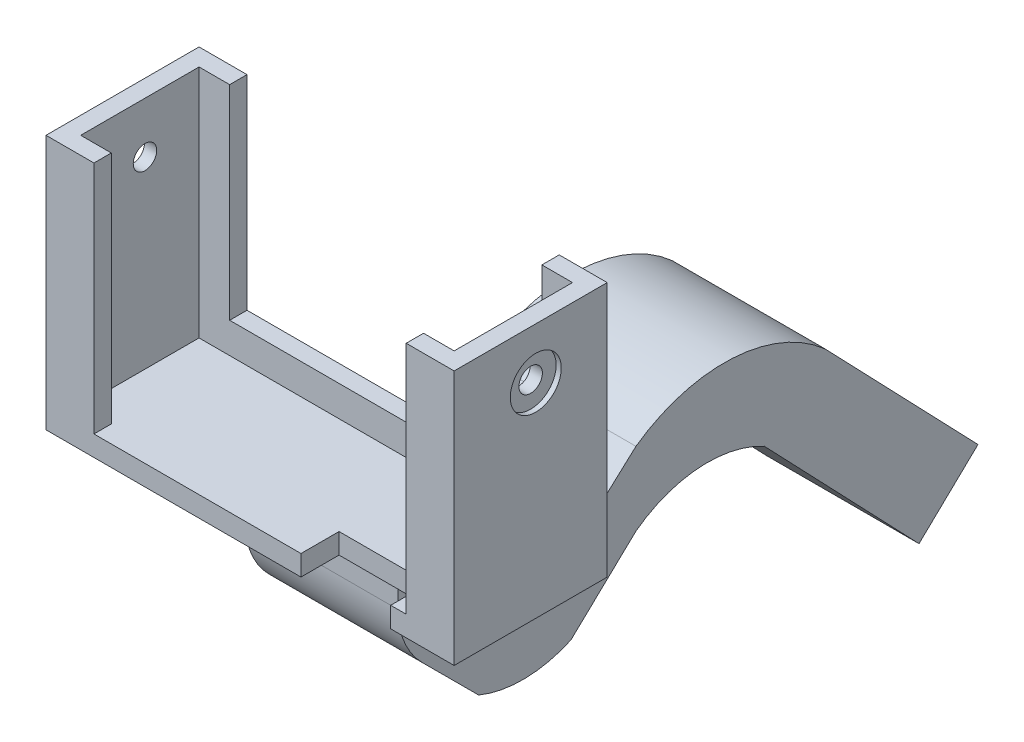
ISO-10303-21;
HEADER;
FILE_DESCRIPTION(('STEP AP214'),'2;1');
FILE_NAME('part.step','',(''),(''),'','','');
FILE_SCHEMA(('AUTOMOTIVE_DESIGN { 1 0 10303 214 1 1 1 1 }'));
ENDSEC;
DATA;
#1=APPLICATION_CONTEXT('core data for automotive mechanical design processes');
#2=APPLICATION_PROTOCOL_DEFINITION('international standard','automotive_design',2000,#1);
#3=PRODUCT_CONTEXT('',#1,'mechanical');
#4=PRODUCT('Part','Part','',(#3));
#5=PRODUCT_RELATED_PRODUCT_CATEGORY('part','',(#4));
#6=PRODUCT_DEFINITION_FORMATION('','',#4);
#7=PRODUCT_DEFINITION_CONTEXT('part definition',#1,'design');
#8=PRODUCT_DEFINITION('design','',#6,#7);
#9=PRODUCT_DEFINITION_SHAPE('','',#8);
#10=(LENGTH_UNIT() NAMED_UNIT(*) SI_UNIT(.MILLI.,.METRE.));
#11=(NAMED_UNIT(*) PLANE_ANGLE_UNIT() SI_UNIT($,.RADIAN.));
#12=(NAMED_UNIT(*) SI_UNIT($,.STERADIAN.) SOLID_ANGLE_UNIT());
#13=UNCERTAINTY_MEASURE_WITH_UNIT(LENGTH_MEASURE(1.E-05),#10,'distance_accuracy_value','');
#14=(GEOMETRIC_REPRESENTATION_CONTEXT(3) GLOBAL_UNCERTAINTY_ASSIGNED_CONTEXT((#13)) GLOBAL_UNIT_ASSIGNED_CONTEXT((#10,
#11,#12)) REPRESENTATION_CONTEXT('',''));
#15=CARTESIAN_POINT('',(0.,0.,0.));
#16=DIRECTION('',(0.,0.,1.));
#17=DIRECTION('',(1.,0.,0.));
#18=AXIS2_PLACEMENT_3D('',#15,#16,#17);
#19=CARTESIAN_POINT('',(-20.,5.,11.));
#20=DIRECTION('',(0.,0.,1.));
#21=DIRECTION('',(1.,0.,0.));
#22=AXIS2_PLACEMENT_3D('',#19,#20,#21);
#23=PLANE('',#22);
#24=DIRECTION('',(0.,1.,0.));
#25=VECTOR('',#24,1.);
#26=CARTESIAN_POINT('',(13.780528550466,-3.,11.));
#27=LINE('',#26,#25);
#28=CARTESIAN_POINT('',(13.780528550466,5.,11.));
#29=VERTEX_POINT('',#28);
#30=CARTESIAN_POINT('',(13.780528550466,7.,11.));
#31=VERTEX_POINT('',#30);
#32=EDGE_CURVE('E523',#29,#31,#27,.T.);
#33=ORIENTED_EDGE('',*,*,#32,.F.);
#34=DIRECTION('',(1.,0.,0.));
#35=VECTOR('',#34,1.);
#36=CARTESIAN_POINT('',(-20.,5.,11.));
#37=LINE('',#36,#35);
#38=CARTESIAN_POINT('',(20.,5.,11.));
#39=VERTEX_POINT('',#38);
#40=EDGE_CURVE('E433',#29,#39,#37,.T.);
#41=ORIENTED_EDGE('',*,*,#40,.T.);
#42=DIRECTION('',(0.,1.,0.));
#43=VECTOR('',#42,1.);
#44=CARTESIAN_POINT('',(20.,5.,11.));
#45=LINE('',#44,#43);
#46=CARTESIAN_POINT('',(20.,30.,11.));
#47=VERTEX_POINT('',#46);
#48=EDGE_CURVE('E438',#39,#47,#45,.T.);
#49=ORIENTED_EDGE('',*,*,#48,.T.);
#50=DIRECTION('',(1.,0.,0.));
#51=VECTOR('',#50,1.);
#52=CARTESIAN_POINT('',(-20.,30.,11.));
#53=LINE('',#52,#51);
#54=CARTESIAN_POINT('',(15.3,30.,11.));
#55=VERTEX_POINT('',#54);
#56=EDGE_CURVE('E419',#55,#47,#53,.T.);
#57=ORIENTED_EDGE('',*,*,#56,.F.);
#58=DIRECTION('',(0.,-1.,0.));
#59=VECTOR('',#58,1.);
#60=CARTESIAN_POINT('',(15.3,30.,11.));
#61=LINE('',#60,#59);
#62=CARTESIAN_POINT('',(15.3,7.,11.));
#63=VERTEX_POINT('',#62);
#64=EDGE_CURVE('E343',#55,#63,#61,.T.);
#65=ORIENTED_EDGE('',*,*,#64,.T.);
#66=DIRECTION('',(1.,0.,0.));
#67=VECTOR('',#66,1.);
#68=CARTESIAN_POINT('',(15.3,7.,11.));
#69=LINE('',#68,#67);
#70=EDGE_CURVE('E332',#31,#63,#69,.T.);
#71=ORIENTED_EDGE('',*,*,#70,.F.);
#72=EDGE_LOOP('',(#33,#41,#49,#57,#65,#71));
#73=FACE_BOUND('',#72,.T.);
#74=ADVANCED_FACE('F39',(#73),#23,.T.);
#75=CARTESIAN_POINT('',(-20.001,25.,3.));
#76=DIRECTION('',(1.,0.,0.));
#77=DIRECTION('',(0.,0.,-1.));
#78=AXIS2_PLACEMENT_3D('',#75,#76,#77);
#79=CYLINDRICAL_SURFACE('',#78,1.15);
#80=CARTESIAN_POINT('',(18.3,25.,3.));
#81=DIRECTION('',(-1.,0.,0.));
#82=DIRECTION('',(0.,0.,1.));
#83=AXIS2_PLACEMENT_3D('',#80,#81,#82);
#84=CIRCLE('',#83,1.15);
#85=CARTESIAN_POINT('',(18.3,25.,4.15));
#86=VERTEX_POINT('',#85);
#87=EDGE_CURVE('E319',#86,#86,#84,.T.);
#88=ORIENTED_EDGE('',*,*,#87,.T.);
#89=EDGE_LOOP('',(#88));
#90=FACE_BOUND('',#89,.T.);
#91=CARTESIAN_POINT('',(19.5,25.,3.));
#92=DIRECTION('',(1.,0.,0.));
#93=DIRECTION('',(0.,0.,-1.));
#94=AXIS2_PLACEMENT_3D('',#91,#92,#93);
#95=CIRCLE('',#94,1.15);
#96=CARTESIAN_POINT('',(19.5,25.,1.85));
#97=VERTEX_POINT('',#96);
#98=EDGE_CURVE('E43',#97,#97,#95,.T.);
#99=ORIENTED_EDGE('',*,*,#98,.T.);
#100=EDGE_LOOP('',(#99));
#101=FACE_BOUND('',#100,.T.);
#102=ADVANCED_FACE('F479',(#90,#101),#79,.F.);
#103=CARTESIAN_POINT('',(20.001,25.,3.));
#104=DIRECTION('',(-1.,0.,0.));
#105=DIRECTION('',(0.,0.,1.));
#106=AXIS2_PLACEMENT_3D('',#103,#104,#105);
#107=CYLINDRICAL_SURFACE('',#106,1.15);
#108=CARTESIAN_POINT('',(-18.3,25.,3.));
#109=DIRECTION('',(1.,0.,0.));
#110=DIRECTION('',(0.,0.,-1.));
#111=AXIS2_PLACEMENT_3D('',#108,#109,#110);
#112=CIRCLE('',#111,1.15);
#113=CARTESIAN_POINT('',(-18.3,25.,1.85));
#114=VERTEX_POINT('',#113);
#115=EDGE_CURVE('E329',#114,#114,#112,.F.);
#116=ORIENTED_EDGE('',*,*,#115,.F.);
#117=EDGE_LOOP('',(#116));
#118=FACE_BOUND('',#117,.T.);
#119=CARTESIAN_POINT('',(-19.5,25.,3.));
#120=DIRECTION('',(-1.,0.,0.));
#121=DIRECTION('',(0.,0.,1.));
#122=AXIS2_PLACEMENT_3D('',#119,#120,#121);
#123=CIRCLE('',#122,1.15);
#124=CARTESIAN_POINT('',(-19.5,25.,4.15));
#125=VERTEX_POINT('',#124);
#126=EDGE_CURVE('E326',#125,#125,#123,.F.);
#127=ORIENTED_EDGE('',*,*,#126,.F.);
#128=EDGE_LOOP('',(#127));
#129=FACE_BOUND('',#128,.T.);
#130=ADVANCED_FACE('F476',(#118,#129),#107,.F.);
#131=CARTESIAN_POINT('',(-18.3,30.,9.3));
#132=DIRECTION('',(0.,0.,-1.));
#133=DIRECTION('',(-1.,0.,0.));
#134=AXIS2_PLACEMENT_3D('',#131,#132,#133);
#135=PLANE('',#134);
#136=DIRECTION('',(0.,1.,0.));
#137=VECTOR('',#136,1.);
#138=CARTESIAN_POINT('',(-15.3,30.,9.3));
#139=LINE('',#138,#137);
#140=CARTESIAN_POINT('',(-15.3,7.,9.3));
#141=VERTEX_POINT('',#140);
#142=CARTESIAN_POINT('',(-15.3,30.,9.3));
#143=VERTEX_POINT('',#142);
#144=EDGE_CURVE('E48',#141,#143,#139,.T.);
#145=ORIENTED_EDGE('',*,*,#144,.F.);
#146=DIRECTION('',(1.,0.,0.));
#147=VECTOR('',#146,1.);
#148=CARTESIAN_POINT('',(-18.3,7.,9.3));
#149=LINE('',#148,#147);
#150=CARTESIAN_POINT('',(-18.3,7.,9.3));
#151=VERTEX_POINT('',#150);
#152=EDGE_CURVE('E378',#151,#141,#149,.T.);
#153=ORIENTED_EDGE('',*,*,#152,.F.);
#154=DIRECTION('',(0.,-1.,0.));
#155=VECTOR('',#154,1.);
#156=CARTESIAN_POINT('',(-18.3,30.,9.3));
#157=LINE('',#156,#155);
#158=CARTESIAN_POINT('',(-18.3,30.,9.3));
#159=VERTEX_POINT('',#158);
#160=EDGE_CURVE('E400',#159,#151,#157,.T.);
#161=ORIENTED_EDGE('',*,*,#160,.F.);
#162=DIRECTION('',(1.,0.,0.));
#163=VECTOR('',#162,1.);
#164=CARTESIAN_POINT('',(-18.3,30.,9.3));
#165=LINE('',#164,#163);
#166=EDGE_CURVE('E386',#159,#143,#165,.T.);
#167=ORIENTED_EDGE('',*,*,#166,.T.);
#168=EDGE_LOOP('',(#145,#153,#161,#167));
#169=FACE_BOUND('',#168,.T.);
#170=ADVANCED_FACE('F478',(#169),#135,.T.);
#171=CARTESIAN_POINT('',(0.,30.,0.));
#172=DIRECTION('',(0.,1.,0.));
#173=DIRECTION('',(0.,0.,1.));
#174=AXIS2_PLACEMENT_3D('',#171,#172,#173);
#175=PLANE('',#174);
#176=DIRECTION('',(0.,0.,-1.));
#177=VECTOR('',#176,1.);
#178=CARTESIAN_POINT('',(15.3,30.,11.));
#179=LINE('',#178,#177);
#180=CARTESIAN_POINT('',(15.3,30.,9.3));
#181=VERTEX_POINT('',#180);
#182=EDGE_CURVE('E357',#55,#181,#179,.T.);
#183=ORIENTED_EDGE('',*,*,#182,.F.);
#184=ORIENTED_EDGE('',*,*,#56,.T.);
#185=DIRECTION('',(0.,0.,-1.));
#186=VECTOR('',#185,1.);
#187=CARTESIAN_POINT('',(20.,30.,-4.));
#188=LINE('',#187,#186);
#189=CARTESIAN_POINT('',(20.,30.,-4.));
#190=VERTEX_POINT('',#189);
#191=EDGE_CURVE('E409',#47,#190,#188,.T.);
#192=ORIENTED_EDGE('',*,*,#191,.T.);
#193=DIRECTION('',(-1.,0.,0.));
#194=VECTOR('',#193,1.);
#195=CARTESIAN_POINT('',(-20.,30.,-4.));
#196=LINE('',#195,#194);
#197=CARTESIAN_POINT('',(15.3,30.,-4.));
#198=VERTEX_POINT('',#197);
#199=EDGE_CURVE('E413',#190,#198,#196,.T.);
#200=ORIENTED_EDGE('',*,*,#199,.T.);
#201=CARTESIAN_POINT('',(15.3,30.,-2.3));
#202=VERTEX_POINT('',#201);
#203=EDGE_CURVE('E360',#202,#198,#179,.T.);
#204=ORIENTED_EDGE('',*,*,#203,.F.);
#205=DIRECTION('',(-1.,0.,0.));
#206=VECTOR('',#205,1.);
#207=CARTESIAN_POINT('',(-18.3,30.,-2.3));
#208=LINE('',#207,#206);
#209=CARTESIAN_POINT('',(18.3,30.,-2.3));
#210=VERTEX_POINT('',#209);
#211=EDGE_CURVE('E379',#210,#202,#208,.T.);
#212=ORIENTED_EDGE('',*,*,#211,.F.);
#213=DIRECTION('',(0.,0.,-1.));
#214=VECTOR('',#213,1.);
#215=CARTESIAN_POINT('',(18.3,30.,-2.3));
#216=LINE('',#215,#214);
#217=CARTESIAN_POINT('',(18.3,30.,9.3));
#218=VERTEX_POINT('',#217);
#219=EDGE_CURVE('E375',#218,#210,#216,.T.);
#220=ORIENTED_EDGE('',*,*,#219,.F.);
#221=EDGE_CURVE('E385',#181,#218,#165,.T.);
#222=ORIENTED_EDGE('',*,*,#221,.F.);
#223=EDGE_LOOP('',(#183,#184,#192,#200,#204,#212,#220,#222));
#224=FACE_BOUND('',#223,.T.);
#225=ADVANCED_FACE('F486',(#224),#175,.T.);
#226=CARTESIAN_POINT('',(7.5,7.,-4.));
#227=DIRECTION('',(-1.,0.,0.));
#228=DIRECTION('',(0.,0.,1.));
#229=AXIS2_PLACEMENT_3D('',#226,#227,#228);
#230=PLANE('',#229);
#231=DIRECTION('',(0.,0.,-1.));
#232=VECTOR('',#231,1.);
#233=CARTESIAN_POINT('',(7.5,5.,-4.));
#234=LINE('',#233,#232);
#235=CARTESIAN_POINT('',(7.5,5.,4.));
#236=VERTEX_POINT('',#235);
#237=CARTESIAN_POINT('',(7.5,5.,-4.));
#238=VERTEX_POINT('',#237);
#239=EDGE_CURVE('E449',#236,#238,#234,.T.);
#240=ORIENTED_EDGE('',*,*,#239,.F.);
#241=DIRECTION('',(0.,-1.,0.));
#242=VECTOR('',#241,1.);
#243=CARTESIAN_POINT('',(7.5,7.,4.));
#244=LINE('',#243,#242);
#245=CARTESIAN_POINT('',(7.49999999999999,0.,4.));
#246=VERTEX_POINT('',#245);
#247=EDGE_CURVE('E457',#236,#246,#244,.T.);
#248=ORIENTED_EDGE('',*,*,#247,.T.);
#249=CARTESIAN_POINT('',(7.49999999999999,0.,-4.));
#250=DIRECTION('',(-1.,0.,0.));
#251=DIRECTION('',(0.,0.,1.));
#252=AXIS2_PLACEMENT_3D('',#249,#250,#251);
#253=CIRCLE('',#252,8.);
#254=CARTESIAN_POINT('',(7.49999999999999,-5.65685424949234,1.65685424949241));
#255=VERTEX_POINT('',#254);
#256=EDGE_CURVE('E318',#246,#255,#253,.F.);
#257=ORIENTED_EDGE('',*,*,#256,.T.);
#258=DIRECTION('',(0.,-0.706826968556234,-0.707386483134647));
#259=VECTOR('',#258,1.);
#260=CARTESIAN_POINT('',(7.49999999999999,-11.213954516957,-3.90464494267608));
#261=LINE('',#260,#259);
#262=CARTESIAN_POINT('',(7.49999999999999,-11.2139545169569,-3.90464494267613));
#263=VERTEX_POINT('',#262);
#264=EDGE_CURVE('E579',#255,#263,#261,.T.);
#265=ORIENTED_EDGE('',*,*,#264,.T.);
#266=CARTESIAN_POINT('',(7.49999999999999,-0.729745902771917,-8.24640038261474));
#267=DIRECTION('',(-1.,0.,0.));
#268=DIRECTION('',(0.,0.,1.));
#269=AXIS2_PLACEMENT_3D('',#266,#267,#268);
#270=CIRCLE('',#269,11.3476636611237);
#271=CARTESIAN_POINT('',(7.49999999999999,-11.0594965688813,-12.9438168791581));
#272=VERTEX_POINT('',#271);
#273=EDGE_CURVE('E577',#263,#272,#270,.F.);
#274=ORIENTED_EDGE('',*,*,#273,.T.);
#275=DIRECTION('',(0.,0.688719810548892,-0.725027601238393));
#276=VECTOR('',#275,1.);
#277=CARTESIAN_POINT('',(7.49999999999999,-11.0594965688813,-12.9438168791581));
#278=LINE('',#277,#276);
#279=CARTESIAN_POINT('',(7.49999999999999,-5.00448849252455,-19.31803163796));
#280=VERTEX_POINT('',#279);
#281=EDGE_CURVE('E575',#272,#280,#278,.T.);
#282=ORIENTED_EDGE('',*,*,#281,.T.);
#283=CARTESIAN_POINT('',(7.49999999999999,-14.4124139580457,-26.3244704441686));
#284=DIRECTION('',(-1.,0.,0.));
#285=DIRECTION('',(0.,0.,1.));
#286=AXIS2_PLACEMENT_3D('',#283,#284,#285);
#287=CIRCLE('',#286,11.7302705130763);
#288=CARTESIAN_POINT('',(7.49999999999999,-4.09263623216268,-31.9013364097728));
#289=VERTEX_POINT('',#288);
#290=EDGE_CURVE('E290',#280,#289,#287,.T.);
#291=ORIENTED_EDGE('',*,*,#290,.T.);
#292=DIRECTION('',(0.,-0.722672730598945,-0.691190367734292));
#293=VECTOR('',#292,1.);
#294=CARTESIAN_POINT('',(7.49999999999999,-4.09263623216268,-31.9013364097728));
#295=LINE('',#294,#293);
#296=CARTESIAN_POINT('',(7.49999999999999,-19.9419368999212,-47.0601814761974));
#297=VERTEX_POINT('',#296);
#298=EDGE_CURVE('E572',#289,#297,#295,.T.);
#299=ORIENTED_EDGE('',*,*,#298,.T.);
#300=DIRECTION('',(0.,0.69119036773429,-0.722672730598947));
#301=VECTOR('',#300,1.);
#302=CARTESIAN_POINT('',(7.49999999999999,-19.9419368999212,-47.0601814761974));
#303=LINE('',#302,#301);
#304=CARTESIAN_POINT('',(7.49999999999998,-14.4124139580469,-52.841563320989));
#305=VERTEX_POINT('',#304);
#306=EDGE_CURVE('E570',#297,#305,#303,.T.);
#307=ORIENTED_EDGE('',*,*,#306,.T.);
#308=DIRECTION('',(0.,0.721242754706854,0.692682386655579));
#309=VECTOR('',#308,1.);
#310=CARTESIAN_POINT('',(7.49999999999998,-14.4124139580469,-52.841563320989));
#311=LINE('',#310,#309);
#312=CARTESIAN_POINT('',(7.49999999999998,1.19381417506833,-37.8533235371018));
#313=VERTEX_POINT('',#312);
#314=EDGE_CURVE('E568',#305,#313,#311,.T.);
#315=ORIENTED_EDGE('',*,*,#314,.T.);
#316=CARTESIAN_POINT('',(7.49999999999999,-9.9342706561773,-27.9587100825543));
#317=DIRECTION('',(-1.,0.,0.));
#318=DIRECTION('',(0.,0.,1.));
#319=AXIS2_PLACEMENT_3D('',#316,#317,#318);
#320=CIRCLE('',#319,14.8908578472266);
#321=CARTESIAN_POINT('',(7.49999999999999,2.1932321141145,-19.3180316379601));
#322=VERTEX_POINT('',#321);
#323=EDGE_CURVE('E566',#313,#322,#320,.F.);
#324=ORIENTED_EDGE('',*,*,#323,.T.);
#325=DIRECTION('',(0.,-0.673918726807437,0.738805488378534));
#326=VECTOR('',#325,1.);
#327=CARTESIAN_POINT('',(7.49999999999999,2.19323211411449,-19.3180316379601));
#328=LINE('',#327,#326);
#329=CARTESIAN_POINT('',(7.49999999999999,-3.62115714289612,-12.9438168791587));
#330=VERTEX_POINT('',#329);
#331=EDGE_CURVE('E564',#322,#330,#328,.T.);
#332=ORIENTED_EDGE('',*,*,#331,.T.);
#333=CARTESIAN_POINT('',(7.49999999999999,2.54718683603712,-10.5830821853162));
#334=DIRECTION('',(-1.,0.,0.));
#335=DIRECTION('',(0.,0.,1.));
#336=AXIS2_PLACEMENT_3D('',#333,#334,#335);
#337=CIRCLE('',#336,6.60466015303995);
#338=CARTESIAN_POINT('',(7.49999999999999,-3.1484017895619,-7.23916144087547));
#339=VERTEX_POINT('',#338);
#340=EDGE_CURVE('E561',#330,#339,#337,.T.);
#341=ORIENTED_EDGE('',*,*,#340,.T.);
#342=DIRECTION('',(0.,0.696989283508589,0.717081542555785));
#343=VECTOR('',#342,1.);
#344=CARTESIAN_POINT('',(7.49999999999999,0.,-4.));
#345=LINE('',#344,#343);
#346=CARTESIAN_POINT('',(7.5,0.,-4.));
#347=VERTEX_POINT('',#346);
#348=EDGE_CURVE('E558',#339,#347,#345,.T.);
#349=ORIENTED_EDGE('',*,*,#348,.T.);
#350=DIRECTION('',(0.,-1.,0.));
#351=VECTOR('',#350,1.);
#352=CARTESIAN_POINT('',(7.5,7.,-4.));
#353=LINE('',#352,#351);
#354=EDGE_CURVE('E466',#238,#347,#353,.T.);
#355=ORIENTED_EDGE('',*,*,#354,.F.);
#356=EDGE_LOOP('',(#240,#248,#257,#265,#274,#282,#291,#299,#307,#315,#324,#332,#341,#349,#355));
#357=FACE_BOUND('',#356,.T.);
#358=ADVANCED_FACE('F41',(#357),#230,.F.);
#359=CARTESIAN_POINT('',(-7.5,7.,-4.));
#360=DIRECTION('',(1.,0.,0.));
#361=DIRECTION('',(0.,0.,-1.));
#362=AXIS2_PLACEMENT_3D('',#359,#360,#361);
#363=PLANE('',#362);
#364=DIRECTION('',(0.,0.,1.));
#365=VECTOR('',#364,1.);
#366=CARTESIAN_POINT('',(-7.5,5.,-4.));
#367=LINE('',#366,#365);
#368=CARTESIAN_POINT('',(-7.5,5.,-4.));
#369=VERTEX_POINT('',#368);
#370=CARTESIAN_POINT('',(-7.5,5.,4.));
#371=VERTEX_POINT('',#370);
#372=EDGE_CURVE('E441',#369,#371,#367,.T.);
#373=ORIENTED_EDGE('',*,*,#372,.F.);
#374=DIRECTION('',(0.,-1.,0.));
#375=VECTOR('',#374,1.);
#376=CARTESIAN_POINT('',(-7.5,7.,-4.));
#377=LINE('',#376,#375);
#378=CARTESIAN_POINT('',(-7.5,0.,-4.));
#379=VERTEX_POINT('',#378);
#380=EDGE_CURVE('E463',#369,#379,#377,.T.);
#381=ORIENTED_EDGE('',*,*,#380,.T.);
#382=DIRECTION('',(0.,-0.696989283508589,-0.717081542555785));
#383=VECTOR('',#382,1.);
#384=CARTESIAN_POINT('',(-7.5,0.,-4.));
#385=LINE('',#384,#383);
#386=CARTESIAN_POINT('',(-7.5,-3.14840178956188,-7.23916144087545));
#387=VERTEX_POINT('',#386);
#388=EDGE_CURVE('E584',#379,#387,#385,.T.);
#389=ORIENTED_EDGE('',*,*,#388,.T.);
#390=CARTESIAN_POINT('',(-7.50000000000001,2.54718683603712,-10.5830821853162));
#391=DIRECTION('',(1.,0.,0.));
#392=DIRECTION('',(0.,0.,1.));
#393=AXIS2_PLACEMENT_3D('',#390,#391,#392);
#394=CIRCLE('',#393,6.60466015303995);
#395=CARTESIAN_POINT('',(-7.50000000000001,-3.62115714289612,-12.9438168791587));
#396=VERTEX_POINT('',#395);
#397=EDGE_CURVE('E587',#387,#396,#394,.T.);
#398=ORIENTED_EDGE('',*,*,#397,.T.);
#399=DIRECTION('',(0.,0.673918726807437,-0.738805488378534));
#400=VECTOR('',#399,1.);
#401=CARTESIAN_POINT('',(-7.50000000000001,2.19323211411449,-19.3180316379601));
#402=LINE('',#401,#400);
#403=CARTESIAN_POINT('',(-7.50000000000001,2.19323211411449,-19.3180316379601));
#404=VERTEX_POINT('',#403);
#405=EDGE_CURVE('E590',#396,#404,#402,.T.);
#406=ORIENTED_EDGE('',*,*,#405,.T.);
#407=CARTESIAN_POINT('',(-7.50000000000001,-9.9342706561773,-27.9587100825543));
#408=DIRECTION('',(-1.,0.,0.));
#409=DIRECTION('',(0.,0.,1.));
#410=AXIS2_PLACEMENT_3D('',#407,#408,#409);
#411=CIRCLE('',#410,14.8908578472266);
#412=CARTESIAN_POINT('',(-7.50000000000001,1.19381417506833,-37.8533235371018));
#413=VERTEX_POINT('',#412);
#414=EDGE_CURVE('E593',#404,#413,#411,.T.);
#415=ORIENTED_EDGE('',*,*,#414,.T.);
#416=DIRECTION('',(0.,-0.721242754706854,-0.692682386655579));
#417=VECTOR('',#416,1.);
#418=CARTESIAN_POINT('',(-7.50000000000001,-14.4124139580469,-52.841563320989));
#419=LINE('',#418,#417);
#420=CARTESIAN_POINT('',(-7.50000000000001,-14.4124139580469,-52.841563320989));
#421=VERTEX_POINT('',#420);
#422=EDGE_CURVE('E596',#413,#421,#419,.T.);
#423=ORIENTED_EDGE('',*,*,#422,.T.);
#424=DIRECTION('',(0.,-0.69119036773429,0.722672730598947));
#425=VECTOR('',#424,1.);
#426=CARTESIAN_POINT('',(-7.50000000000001,-19.9419368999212,-47.0601814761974));
#427=LINE('',#426,#425);
#428=CARTESIAN_POINT('',(-7.50000000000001,-19.9419368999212,-47.0601814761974));
#429=VERTEX_POINT('',#428);
#430=EDGE_CURVE('E599',#421,#429,#427,.T.);
#431=ORIENTED_EDGE('',*,*,#430,.T.);
#432=DIRECTION('',(0.,0.722672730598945,0.691190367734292));
#433=VECTOR('',#432,1.);
#434=CARTESIAN_POINT('',(-7.50000000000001,-4.09263623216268,-31.9013364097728));
#435=LINE('',#434,#433);
#436=CARTESIAN_POINT('',(-7.50000000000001,-4.09263623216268,-31.9013364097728));
#437=VERTEX_POINT('',#436);
#438=EDGE_CURVE('E602',#429,#437,#435,.T.);
#439=ORIENTED_EDGE('',*,*,#438,.T.);
#440=CARTESIAN_POINT('',(-7.50000000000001,-14.4124139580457,-26.3244704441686));
#441=DIRECTION('',(1.,0.,0.));
#442=DIRECTION('',(0.,0.,1.));
#443=AXIS2_PLACEMENT_3D('',#440,#441,#442);
#444=CIRCLE('',#443,11.7302705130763);
#445=CARTESIAN_POINT('',(-7.50000000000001,-5.00448849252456,-19.31803163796));
#446=VERTEX_POINT('',#445);
#447=EDGE_CURVE('E605',#437,#446,#444,.T.);
#448=ORIENTED_EDGE('',*,*,#447,.T.);
#449=DIRECTION('',(0.,-0.688719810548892,0.725027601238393));
#450=VECTOR('',#449,1.);
#451=CARTESIAN_POINT('',(-7.50000000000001,-11.0594965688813,-12.9438168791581));
#452=LINE('',#451,#450);
#453=CARTESIAN_POINT('',(-7.50000000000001,-11.0594965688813,-12.9438168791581));
#454=VERTEX_POINT('',#453);
#455=EDGE_CURVE('E608',#446,#454,#452,.T.);
#456=ORIENTED_EDGE('',*,*,#455,.T.);
#457=CARTESIAN_POINT('',(-7.5,-0.729745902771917,-8.24640038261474));
#458=DIRECTION('',(-1.,0.,0.));
#459=DIRECTION('',(0.,0.,1.));
#460=AXIS2_PLACEMENT_3D('',#457,#458,#459);
#461=CIRCLE('',#460,11.3476636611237);
#462=CARTESIAN_POINT('',(-7.5,-11.2139545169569,-3.90464494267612));
#463=VERTEX_POINT('',#462);
#464=EDGE_CURVE('E611',#454,#463,#461,.T.);
#465=ORIENTED_EDGE('',*,*,#464,.T.);
#466=DIRECTION('',(0.,0.706826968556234,0.707386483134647));
#467=VECTOR('',#466,1.);
#468=CARTESIAN_POINT('',(-7.5,-11.213954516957,-3.90464494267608));
#469=LINE('',#468,#467);
#470=CARTESIAN_POINT('',(-7.5,-5.65685424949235,1.65685424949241));
#471=VERTEX_POINT('',#470);
#472=EDGE_CURVE('E311',#463,#471,#469,.T.);
#473=ORIENTED_EDGE('',*,*,#472,.T.);
#474=CARTESIAN_POINT('',(-7.5,0.,-4.));
#475=DIRECTION('',(-1.,0.,0.));
#476=DIRECTION('',(0.,0.,-1.));
#477=AXIS2_PLACEMENT_3D('',#474,#475,#476);
#478=CIRCLE('',#477,8.);
#479=CARTESIAN_POINT('',(-7.5,0.,4.));
#480=VERTEX_POINT('',#479);
#481=EDGE_CURVE('E553',#471,#480,#478,.T.);
#482=ORIENTED_EDGE('',*,*,#481,.T.);
#483=DIRECTION('',(0.,-1.,0.));
#484=VECTOR('',#483,1.);
#485=CARTESIAN_POINT('',(-7.5,7.,4.));
#486=LINE('',#485,#484);
#487=EDGE_CURVE('E460',#371,#480,#486,.T.);
#488=ORIENTED_EDGE('',*,*,#487,.F.);
#489=EDGE_LOOP('',(#373,#381,#389,#398,#406,#415,#423,#431,#439,#448,#456,#465,#473,#482,#488));
#490=FACE_BOUND('',#489,.T.);
#491=ADVANCED_FACE('F627',(#490),#363,.F.);
#492=CARTESIAN_POINT('',(-7.5,7.,4.));
#493=DIRECTION('',(0.,0.,-1.));
#494=DIRECTION('',(-1.,0.,0.));
#495=AXIS2_PLACEMENT_3D('',#492,#493,#494);
#496=PLANE('',#495);
#497=DIRECTION('',(1.,0.,0.));
#498=VECTOR('',#497,1.);
#499=CARTESIAN_POINT('',(-7.5,5.,4.));
#500=LINE('',#499,#498);
#501=EDGE_CURVE('E469',#371,#236,#500,.T.);
#502=ORIENTED_EDGE('',*,*,#501,.F.);
#503=ORIENTED_EDGE('',*,*,#487,.T.);
#504=DIRECTION('',(1.,0.,0.));
#505=VECTOR('',#504,1.);
#506=CARTESIAN_POINT('',(-7.5,0.,4.));
#507=LINE('',#506,#505);
#508=EDGE_CURVE('E454',#480,#246,#507,.T.);
#509=ORIENTED_EDGE('',*,*,#508,.T.);
#510=ORIENTED_EDGE('',*,*,#247,.F.);
#511=EDGE_LOOP('',(#502,#503,#509,#510));
#512=FACE_BOUND('',#511,.T.);
#513=ADVANCED_FACE('F636',(#512),#496,.F.);
#514=CARTESIAN_POINT('',(-7.5,7.,-4.));
#515=DIRECTION('',(0.,0.,1.));
#516=DIRECTION('',(1.,0.,0.));
#517=AXIS2_PLACEMENT_3D('',#514,#515,#516);
#518=PLANE('',#517);
#519=DIRECTION('',(-1.,0.,0.));
#520=VECTOR('',#519,1.);
#521=CARTESIAN_POINT('',(15.3,10.,-4.));
#522=LINE('',#521,#520);
#523=CARTESIAN_POINT('',(15.3,10.,-4.));
#524=VERTEX_POINT('',#523);
#525=CARTESIAN_POINT('',(-15.3,10.,-4.));
#526=VERTEX_POINT('',#525);
#527=EDGE_CURVE('E353',#524,#526,#522,.T.);
#528=ORIENTED_EDGE('',*,*,#527,.F.);
#529=DIRECTION('',(0.,-1.,0.));
#530=VECTOR('',#529,1.);
#531=CARTESIAN_POINT('',(15.3,30.,-4.));
#532=LINE('',#531,#530);
#533=EDGE_CURVE('E340',#198,#524,#532,.T.);
#534=ORIENTED_EDGE('',*,*,#533,.F.);
#535=ORIENTED_EDGE('',*,*,#199,.F.);
#536=DIRECTION('',(0.,1.,0.));
#537=VECTOR('',#536,1.);
#538=CARTESIAN_POINT('',(20.,5.,-4.));
#539=LINE('',#538,#537);
#540=CARTESIAN_POINT('',(20.,5.,-4.));
#541=VERTEX_POINT('',#540);
#542=EDGE_CURVE('E437',#541,#190,#539,.T.);
#543=ORIENTED_EDGE('',*,*,#542,.F.);
#544=DIRECTION('',(-1.,0.,0.));
#545=VECTOR('',#544,1.);
#546=CARTESIAN_POINT('',(-20.,5.,-4.));
#547=LINE('',#546,#545);
#548=EDGE_CURVE('E427',#541,#238,#547,.T.);
#549=ORIENTED_EDGE('',*,*,#548,.T.);
#550=ORIENTED_EDGE('',*,*,#354,.T.);
#551=DIRECTION('',(-1.,0.,0.));
#552=VECTOR('',#551,1.);
#553=CARTESIAN_POINT('',(-7.5,0.,-4.));
#554=LINE('',#553,#552);
#555=EDGE_CURVE('E451',#347,#379,#554,.T.);
#556=ORIENTED_EDGE('',*,*,#555,.T.);
#557=ORIENTED_EDGE('',*,*,#380,.F.);
#558=CARTESIAN_POINT('',(-20.,5.,-4.));
#559=VERTEX_POINT('',#558);
#560=EDGE_CURVE('E426',#369,#559,#547,.T.);
#561=ORIENTED_EDGE('',*,*,#560,.T.);
#562=DIRECTION('',(0.,1.,0.));
#563=VECTOR('',#562,1.);
#564=CARTESIAN_POINT('',(-20.,5.,-4.));
#565=LINE('',#564,#563);
#566=CARTESIAN_POINT('',(-20.,30.,-4.));
#567=VERTEX_POINT('',#566);
#568=EDGE_CURVE('E444',#559,#567,#565,.T.);
#569=ORIENTED_EDGE('',*,*,#568,.T.);
#570=CARTESIAN_POINT('',(-15.3,30.,-4.));
#571=VERTEX_POINT('',#570);
#572=EDGE_CURVE('E412',#571,#567,#196,.T.);
#573=ORIENTED_EDGE('',*,*,#572,.F.);
#574=DIRECTION('',(0.,1.,0.));
#575=VECTOR('',#574,1.);
#576=CARTESIAN_POINT('',(-15.3,30.,-4.));
#577=LINE('',#576,#575);
#578=EDGE_CURVE('E347',#526,#571,#577,.T.);
#579=ORIENTED_EDGE('',*,*,#578,.F.);
#580=EDGE_LOOP('',(#528,#534,#535,#543,#549,#550,#556,#557,#561,#569,#573,#579));
#581=FACE_BOUND('',#580,.T.);
#582=ADVANCED_FACE('F645',(#581),#518,.F.);
#583=CARTESIAN_POINT('',(0.,5.,0.));
#584=DIRECTION('',(0.,1.,0.));
#585=DIRECTION('',(0.,0.,1.));
#586=AXIS2_PLACEMENT_3D('',#583,#584,#585);
#587=PLANE('',#586);
#588=ORIENTED_EDGE('',*,*,#40,.F.);
#589=DIRECTION('',(0.,0.,-1.));
#590=VECTOR('',#589,1.);
#591=CARTESIAN_POINT('',(13.780528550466,5.,0.));
#592=LINE('',#591,#590);
#593=CARTESIAN_POINT('',(13.780528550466,5.,7.26852262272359));
#594=VERTEX_POINT('',#593);
#595=EDGE_CURVE('E551',#29,#594,#592,.T.);
#596=ORIENTED_EDGE('',*,*,#595,.T.);
#597=DIRECTION('',(-1.,0.,0.));
#598=VECTOR('',#597,1.);
#599=CARTESIAN_POINT('',(0.,5.,7.26852262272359));
#600=LINE('',#599,#598);
#601=CARTESIAN_POINT('',(4.99000191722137,5.,7.26852262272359));
#602=VERTEX_POINT('',#601);
#603=EDGE_CURVE('E549',#594,#602,#600,.T.);
#604=ORIENTED_EDGE('',*,*,#603,.T.);
#605=DIRECTION('',(0.,0.,1.));
#606=VECTOR('',#605,1.);
#607=CARTESIAN_POINT('',(4.99000191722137,5.,0.));
#608=LINE('',#607,#606);
#609=CARTESIAN_POINT('',(4.99000191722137,5.,11.));
#610=VERTEX_POINT('',#609);
#611=EDGE_CURVE('E547',#602,#610,#608,.T.);
#612=ORIENTED_EDGE('',*,*,#611,.T.);
#613=CARTESIAN_POINT('',(-20.,5.,11.));
#614=VERTEX_POINT('',#613);
#615=EDGE_CURVE('E434',#614,#610,#37,.T.);
#616=ORIENTED_EDGE('',*,*,#615,.F.);
#617=DIRECTION('',(0.,0.,1.));
#618=VECTOR('',#617,1.);
#619=CARTESIAN_POINT('',(-20.,5.,-4.));
#620=LINE('',#619,#618);
#621=EDGE_CURVE('E430',#559,#614,#620,.T.);
#622=ORIENTED_EDGE('',*,*,#621,.F.);
#623=ORIENTED_EDGE('',*,*,#560,.F.);
#624=ORIENTED_EDGE('',*,*,#372,.T.);
#625=ORIENTED_EDGE('',*,*,#501,.T.);
#626=ORIENTED_EDGE('',*,*,#239,.T.);
#627=ORIENTED_EDGE('',*,*,#548,.F.);
#628=DIRECTION('',(0.,0.,-1.));
#629=VECTOR('',#628,1.);
#630=CARTESIAN_POINT('',(20.,5.,-4.));
#631=LINE('',#630,#629);
#632=EDGE_CURVE('E423',#39,#541,#631,.T.);
#633=ORIENTED_EDGE('',*,*,#632,.F.);
#634=EDGE_LOOP('',(#588,#596,#604,#612,#616,#622,#623,#624,#625,#626,#627,#633));
#635=FACE_BOUND('',#634,.T.);
#636=ADVANCED_FACE('F514',(#635),#587,.F.);
#637=CARTESIAN_POINT('',(20.,5.,-4.));
#638=DIRECTION('',(1.,0.,0.));
#639=DIRECTION('',(0.,0.,-1.));
#640=AXIS2_PLACEMENT_3D('',#637,#638,#639);
#641=PLANE('',#640);
#642=CARTESIAN_POINT('',(20.,25.,3.));
#643=DIRECTION('',(-1.,0.,0.));
#644=DIRECTION('',(0.,0.,1.));
#645=AXIS2_PLACEMENT_3D('',#642,#643,#644);
#646=CIRCLE('',#645,2.5);
#647=CARTESIAN_POINT('',(20.,25.,5.5));
#648=VERTEX_POINT('',#647);
#649=EDGE_CURVE('E315',#648,#648,#646,.T.);
#650=ORIENTED_EDGE('',*,*,#649,.T.);
#651=EDGE_LOOP('',(#650));
#652=FACE_BOUND('',#651,.T.);
#653=ORIENTED_EDGE('',*,*,#542,.T.);
#654=ORIENTED_EDGE('',*,*,#191,.F.);
#655=ORIENTED_EDGE('',*,*,#48,.F.);
#656=ORIENTED_EDGE('',*,*,#632,.T.);
#657=EDGE_LOOP('',(#653,#654,#655,#656));
#658=FACE_BOUND('',#657,.T.);
#659=ADVANCED_FACE('F506',(#652,#658),#641,.T.);
#660=DIRECTION('',(0.,1.,0.));
#661=VECTOR('',#660,1.);
#662=CARTESIAN_POINT('',(4.99000191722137,-3.,11.));
#663=LINE('',#662,#661);
#664=CARTESIAN_POINT('',(4.99000191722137,7.,11.));
#665=VERTEX_POINT('',#664);
#666=EDGE_CURVE('E519',#610,#665,#663,.T.);
#667=ORIENTED_EDGE('',*,*,#666,.T.);
#668=CARTESIAN_POINT('',(-15.3,7.,11.));
#669=VERTEX_POINT('',#668);
#670=EDGE_CURVE('E333',#669,#665,#69,.T.);
#671=ORIENTED_EDGE('',*,*,#670,.F.);
#672=DIRECTION('',(0.,1.,0.));
#673=VECTOR('',#672,1.);
#674=CARTESIAN_POINT('',(-15.3,30.,11.));
#675=LINE('',#674,#673);
#676=CARTESIAN_POINT('',(-15.3,30.,11.));
#677=VERTEX_POINT('',#676);
#678=EDGE_CURVE('E346',#669,#677,#675,.T.);
#679=ORIENTED_EDGE('',*,*,#678,.T.);
#680=CARTESIAN_POINT('',(-20.,30.,11.));
#681=VERTEX_POINT('',#680);
#682=EDGE_CURVE('E420',#681,#677,#53,.T.);
#683=ORIENTED_EDGE('',*,*,#682,.F.);
#684=DIRECTION('',(0.,1.,0.));
#685=VECTOR('',#684,1.);
#686=CARTESIAN_POINT('',(-20.,5.,11.));
#687=LINE('',#686,#685);
#688=EDGE_CURVE('E442',#614,#681,#687,.T.);
#689=ORIENTED_EDGE('',*,*,#688,.F.);
#690=ORIENTED_EDGE('',*,*,#615,.T.);
#691=EDGE_LOOP('',(#667,#671,#679,#683,#689,#690));
#692=FACE_BOUND('',#691,.T.);
#693=ADVANCED_FACE('F498',(#692),#23,.T.);
#694=CARTESIAN_POINT('',(-20.,5.,-4.));
#695=DIRECTION('',(-1.,0.,0.));
#696=DIRECTION('',(0.,0.,1.));
#697=AXIS2_PLACEMENT_3D('',#694,#695,#696);
#698=PLANE('',#697);
#699=CARTESIAN_POINT('',(-20.,25.,3.));
#700=DIRECTION('',(-1.,0.,0.));
#701=DIRECTION('',(0.,0.,1.));
#702=AXIS2_PLACEMENT_3D('',#699,#700,#701);
#703=CIRCLE('',#702,2.5);
#704=CARTESIAN_POINT('',(-20.,25.,5.5));
#705=VERTEX_POINT('',#704);
#706=EDGE_CURVE('E322',#705,#705,#703,.T.);
#707=ORIENTED_EDGE('',*,*,#706,.F.);
#708=EDGE_LOOP('',(#707));
#709=FACE_BOUND('',#708,.T.);
#710=ORIENTED_EDGE('',*,*,#688,.T.);
#711=DIRECTION('',(0.,0.,1.));
#712=VECTOR('',#711,1.);
#713=CARTESIAN_POINT('',(-20.,30.,-4.));
#714=LINE('',#713,#712);
#715=EDGE_CURVE('E416',#567,#681,#714,.T.);
#716=ORIENTED_EDGE('',*,*,#715,.F.);
#717=ORIENTED_EDGE('',*,*,#568,.F.);
#718=ORIENTED_EDGE('',*,*,#621,.T.);
#719=EDGE_LOOP('',(#710,#716,#717,#718));
#720=FACE_BOUND('',#719,.T.);
#721=ADVANCED_FACE('F505',(#709,#720),#698,.T.);
#722=DIRECTION('',(0.,0.,-1.));
#723=VECTOR('',#722,1.);
#724=CARTESIAN_POINT('',(-15.3,30.,11.));
#725=LINE('',#724,#723);
#726=CARTESIAN_POINT('',(-15.3,30.,-2.3));
#727=VERTEX_POINT('',#726);
#728=EDGE_CURVE('E364',#727,#571,#725,.T.);
#729=ORIENTED_EDGE('',*,*,#728,.T.);
#730=ORIENTED_EDGE('',*,*,#572,.T.);
#731=ORIENTED_EDGE('',*,*,#715,.T.);
#732=ORIENTED_EDGE('',*,*,#682,.T.);
#733=EDGE_CURVE('E361',#677,#143,#725,.T.);
#734=ORIENTED_EDGE('',*,*,#733,.T.);
#735=ORIENTED_EDGE('',*,*,#166,.F.);
#736=DIRECTION('',(0.,0.,1.));
#737=VECTOR('',#736,1.);
#738=CARTESIAN_POINT('',(-18.3,30.,-2.3));
#739=LINE('',#738,#737);
#740=CARTESIAN_POINT('',(-18.3,30.,-2.3));
#741=VERTEX_POINT('',#740);
#742=EDGE_CURVE('E382',#741,#159,#739,.T.);
#743=ORIENTED_EDGE('',*,*,#742,.F.);
#744=EDGE_CURVE('E377',#727,#741,#208,.T.);
#745=ORIENTED_EDGE('',*,*,#744,.F.);
#746=EDGE_LOOP('',(#729,#730,#731,#732,#734,#735,#743,#745));
#747=FACE_BOUND('',#746,.T.);
#748=ADVANCED_FACE('F512',(#747),#175,.T.);
#749=CARTESIAN_POINT('',(18.3,30.,-2.3));
#750=DIRECTION('',(-1.,0.,0.));
#751=DIRECTION('',(0.,0.,1.));
#752=AXIS2_PLACEMENT_3D('',#749,#750,#751);
#753=PLANE('',#752);
#754=ORIENTED_EDGE('',*,*,#87,.F.);
#755=EDGE_LOOP('',(#754));
#756=FACE_BOUND('',#755,.T.);
#757=DIRECTION('',(0.,0.,-1.));
#758=VECTOR('',#757,1.);
#759=CARTESIAN_POINT('',(18.3,7.,-2.3));
#760=LINE('',#759,#758);
#761=CARTESIAN_POINT('',(18.3,7.,9.3));
#762=VERTEX_POINT('',#761);
#763=CARTESIAN_POINT('',(18.3,7.,-2.3));
#764=VERTEX_POINT('',#763);
#765=EDGE_CURVE('E374',#762,#764,#760,.T.);
#766=ORIENTED_EDGE('',*,*,#765,.F.);
#767=DIRECTION('',(0.,-1.,0.));
#768=VECTOR('',#767,1.);
#769=CARTESIAN_POINT('',(18.3,30.,9.3));
#770=LINE('',#769,#768);
#771=EDGE_CURVE('E389',#218,#762,#770,.T.);
#772=ORIENTED_EDGE('',*,*,#771,.F.);
#773=ORIENTED_EDGE('',*,*,#219,.T.);
#774=DIRECTION('',(0.,-1.,0.));
#775=VECTOR('',#774,1.);
#776=CARTESIAN_POINT('',(18.3,30.,-2.3));
#777=LINE('',#776,#775);
#778=EDGE_CURVE('E406',#210,#764,#777,.T.);
#779=ORIENTED_EDGE('',*,*,#778,.T.);
#780=EDGE_LOOP('',(#766,#772,#773,#779));
#781=FACE_BOUND('',#780,.T.);
#782=ADVANCED_FACE('F1034',(#756,#781),#753,.T.);
#783=CARTESIAN_POINT('',(-18.3,30.,-2.3));
#784=DIRECTION('',(0.,0.,1.));
#785=DIRECTION('',(1.,0.,0.));
#786=AXIS2_PLACEMENT_3D('',#783,#784,#785);
#787=PLANE('',#786);
#788=DIRECTION('',(0.,1.,0.));
#789=VECTOR('',#788,1.);
#790=CARTESIAN_POINT('',(15.3,30.,-2.3));
#791=LINE('',#790,#789);
#792=CARTESIAN_POINT('',(15.3,10.,-2.3));
#793=VERTEX_POINT('',#792);
#794=EDGE_CURVE('E372',#793,#202,#791,.T.);
#795=ORIENTED_EDGE('',*,*,#794,.F.);
#796=DIRECTION('',(1.,0.,0.));
#797=VECTOR('',#796,1.);
#798=CARTESIAN_POINT('',(-18.3,10.,-2.3));
#799=LINE('',#798,#797);
#800=CARTESIAN_POINT('',(-15.3,10.,-2.3));
#801=VERTEX_POINT('',#800);
#802=EDGE_CURVE('E359',#801,#793,#799,.T.);
#803=ORIENTED_EDGE('',*,*,#802,.F.);
#804=DIRECTION('',(0.,-1.,0.));
#805=VECTOR('',#804,1.);
#806=CARTESIAN_POINT('',(-15.3,30.,-2.3));
#807=LINE('',#806,#805);
#808=EDGE_CURVE('E369',#727,#801,#807,.T.);
#809=ORIENTED_EDGE('',*,*,#808,.F.);
#810=ORIENTED_EDGE('',*,*,#744,.T.);
#811=DIRECTION('',(0.,-1.,0.));
#812=VECTOR('',#811,1.);
#813=CARTESIAN_POINT('',(-18.3,30.,-2.3));
#814=LINE('',#813,#812);
#815=CARTESIAN_POINT('',(-18.3,7.,-2.3));
#816=VERTEX_POINT('',#815);
#817=EDGE_CURVE('E403',#741,#816,#814,.T.);
#818=ORIENTED_EDGE('',*,*,#817,.T.);
#819=DIRECTION('',(-1.,0.,0.));
#820=VECTOR('',#819,1.);
#821=CARTESIAN_POINT('',(-18.3,7.,-2.3));
#822=LINE('',#821,#820);
#823=EDGE_CURVE('E391',#764,#816,#822,.T.);
#824=ORIENTED_EDGE('',*,*,#823,.F.);
#825=ORIENTED_EDGE('',*,*,#778,.F.);
#826=ORIENTED_EDGE('',*,*,#211,.T.);
#827=EDGE_LOOP('',(#795,#803,#809,#810,#818,#824,#825,#826));
#828=FACE_BOUND('',#827,.T.);
#829=ADVANCED_FACE('F1025',(#828),#787,.T.);
#830=CARTESIAN_POINT('',(-18.3,30.,-2.3));
#831=DIRECTION('',(1.,0.,0.));
#832=DIRECTION('',(0.,0.,-1.));
#833=AXIS2_PLACEMENT_3D('',#830,#831,#832);
#834=PLANE('',#833);
#835=ORIENTED_EDGE('',*,*,#115,.T.);
#836=EDGE_LOOP('',(#835));
#837=FACE_BOUND('',#836,.T.);
#838=DIRECTION('',(0.,0.,1.));
#839=VECTOR('',#838,1.);
#840=CARTESIAN_POINT('',(-18.3,7.,-2.3));
#841=LINE('',#840,#839);
#842=EDGE_CURVE('E393',#816,#151,#841,.T.);
#843=ORIENTED_EDGE('',*,*,#842,.F.);
#844=ORIENTED_EDGE('',*,*,#817,.F.);
#845=ORIENTED_EDGE('',*,*,#742,.T.);
#846=ORIENTED_EDGE('',*,*,#160,.T.);
#847=EDGE_LOOP('',(#843,#844,#845,#846));
#848=FACE_BOUND('',#847,.T.);
#849=ADVANCED_FACE('F1017',(#837,#848),#834,.T.);
#850=CARTESIAN_POINT('',(15.3,7.,9.3));
#851=VERTEX_POINT('',#850);
#852=EDGE_CURVE('E395',#851,#762,#149,.T.);
#853=ORIENTED_EDGE('',*,*,#852,.F.);
#854=DIRECTION('',(0.,-1.,0.));
#855=VECTOR('',#854,1.);
#856=CARTESIAN_POINT('',(15.3,30.,9.3));
#857=LINE('',#856,#855);
#858=EDGE_CURVE('E11',#181,#851,#857,.T.);
#859=ORIENTED_EDGE('',*,*,#858,.F.);
#860=ORIENTED_EDGE('',*,*,#221,.T.);
#861=ORIENTED_EDGE('',*,*,#771,.T.);
#862=EDGE_LOOP('',(#853,#859,#860,#861));
#863=FACE_BOUND('',#862,.T.);
#864=ADVANCED_FACE('F489',(#863),#135,.T.);
#865=CARTESIAN_POINT('',(0.,7.,0.));
#866=DIRECTION('',(0.,1.,0.));
#867=DIRECTION('',(0.,0.,1.));
#868=AXIS2_PLACEMENT_3D('',#865,#866,#867);
#869=PLANE('',#868);
#870=DIRECTION('',(0.,0.,-1.));
#871=VECTOR('',#870,1.);
#872=CARTESIAN_POINT('',(13.780528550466,7.,11.));
#873=LINE('',#872,#871);
#874=CARTESIAN_POINT('',(13.780528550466,7.,7.26852262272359));
#875=VERTEX_POINT('',#874);
#876=EDGE_CURVE('E63',#31,#875,#873,.T.);
#877=ORIENTED_EDGE('',*,*,#876,.F.);
#878=ORIENTED_EDGE('',*,*,#70,.T.);
#879=DIRECTION('',(0.,0.,1.));
#880=VECTOR('',#879,1.);
#881=CARTESIAN_POINT('',(15.3,7.,-4.001));
#882=LINE('',#881,#880);
#883=EDGE_CURVE('E337',#851,#63,#882,.T.);
#884=ORIENTED_EDGE('',*,*,#883,.F.);
#885=ORIENTED_EDGE('',*,*,#852,.T.);
#886=ORIENTED_EDGE('',*,*,#765,.T.);
#887=ORIENTED_EDGE('',*,*,#823,.T.);
#888=ORIENTED_EDGE('',*,*,#842,.T.);
#889=ORIENTED_EDGE('',*,*,#152,.T.);
#890=DIRECTION('',(0.,0.,1.));
#891=VECTOR('',#890,1.);
#892=CARTESIAN_POINT('',(-15.3,7.,-4.001));
#893=LINE('',#892,#891);
#894=EDGE_CURVE('E336',#141,#669,#893,.T.);
#895=ORIENTED_EDGE('',*,*,#894,.T.);
#896=ORIENTED_EDGE('',*,*,#670,.T.);
#897=DIRECTION('',(0.,0.,1.));
#898=VECTOR('',#897,1.);
#899=CARTESIAN_POINT('',(4.99000191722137,7.,11.));
#900=LINE('',#899,#898);
#901=CARTESIAN_POINT('',(4.99000191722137,7.,7.26852262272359));
#902=VERTEX_POINT('',#901);
#903=EDGE_CURVE('E530',#902,#665,#900,.T.);
#904=ORIENTED_EDGE('',*,*,#903,.F.);
#905=DIRECTION('',(-1.,0.,0.));
#906=VECTOR('',#905,1.);
#907=CARTESIAN_POINT('',(13.780528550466,7.,7.26852262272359));
#908=LINE('',#907,#906);
#909=EDGE_CURVE('E659',#875,#902,#908,.T.);
#910=ORIENTED_EDGE('',*,*,#909,.F.);
#911=EDGE_LOOP('',(#877,#878,#884,#885,#886,#887,#888,#889,#895,#896,#904,#910));
#912=FACE_BOUND('',#911,.T.);
#913=ADVANCED_FACE('F528',(#912),#869,.T.);
#914=CARTESIAN_POINT('',(-15.3,30.,11.));
#915=DIRECTION('',(-1.,0.,0.));
#916=DIRECTION('',(0.,-1.,0.));
#917=AXIS2_PLACEMENT_3D('',#914,#915,#916);
#918=PLANE('',#917);
#919=ORIENTED_EDGE('',*,*,#144,.T.);
#920=ORIENTED_EDGE('',*,*,#733,.F.);
#921=ORIENTED_EDGE('',*,*,#678,.F.);
#922=ORIENTED_EDGE('',*,*,#894,.F.);
#923=EDGE_LOOP('',(#919,#920,#921,#922));
#924=FACE_BOUND('',#923,.T.);
#925=ADVANCED_FACE('F534',(#924),#918,.F.);
#926=CARTESIAN_POINT('',(15.3,30.,11.));
#927=DIRECTION('',(1.,0.,0.));
#928=DIRECTION('',(0.,1.,0.));
#929=AXIS2_PLACEMENT_3D('',#926,#927,#928);
#930=PLANE('',#929);
#931=ORIENTED_EDGE('',*,*,#858,.T.);
#932=ORIENTED_EDGE('',*,*,#883,.T.);
#933=ORIENTED_EDGE('',*,*,#64,.F.);
#934=ORIENTED_EDGE('',*,*,#182,.T.);
#935=EDGE_LOOP('',(#931,#932,#933,#934));
#936=FACE_BOUND('',#935,.T.);
#937=ADVANCED_FACE('F985',(#936),#930,.F.);
#938=ORIENTED_EDGE('',*,*,#794,.T.);
#939=ORIENTED_EDGE('',*,*,#203,.T.);
#940=ORIENTED_EDGE('',*,*,#533,.T.);
#941=DIRECTION('',(0.,0.,-1.));
#942=VECTOR('',#941,1.);
#943=CARTESIAN_POINT('',(15.3,10.,11.));
#944=LINE('',#943,#942);
#945=EDGE_CURVE('E350',#793,#524,#944,.T.);
#946=ORIENTED_EDGE('',*,*,#945,.F.);
#947=EDGE_LOOP('',(#938,#939,#940,#946));
#948=FACE_BOUND('',#947,.T.);
#949=ADVANCED_FACE('F976',(#948),#930,.F.);
#950=ORIENTED_EDGE('',*,*,#808,.T.);
#951=DIRECTION('',(0.,0.,-1.));
#952=VECTOR('',#951,1.);
#953=CARTESIAN_POINT('',(-15.3,10.,11.));
#954=LINE('',#953,#952);
#955=EDGE_CURVE('E365',#801,#526,#954,.T.);
#956=ORIENTED_EDGE('',*,*,#955,.T.);
#957=ORIENTED_EDGE('',*,*,#578,.T.);
#958=ORIENTED_EDGE('',*,*,#728,.F.);
#959=EDGE_LOOP('',(#950,#956,#957,#958));
#960=FACE_BOUND('',#959,.T.);
#961=ADVANCED_FACE('F967',(#960),#918,.F.);
#962=CARTESIAN_POINT('',(15.3,10.,11.));
#963=DIRECTION('',(0.,-1.,0.));
#964=DIRECTION('',(0.,0.,-1.));
#965=AXIS2_PLACEMENT_3D('',#962,#963,#964);
#966=PLANE('',#965);
#967=ORIENTED_EDGE('',*,*,#802,.T.);
#968=ORIENTED_EDGE('',*,*,#945,.T.);
#969=ORIENTED_EDGE('',*,*,#527,.T.);
#970=ORIENTED_EDGE('',*,*,#955,.F.);
#971=EDGE_LOOP('',(#967,#968,#969,#970));
#972=FACE_BOUND('',#971,.T.);
#973=ADVANCED_FACE('F737',(#972),#966,.F.);
#974=CARTESIAN_POINT('',(-19.5,25.,3.));
#975=DIRECTION('',(-1.,0.,0.));
#976=DIRECTION('',(0.,0.,1.));
#977=AXIS2_PLACEMENT_3D('',#974,#975,#976);
#978=PLANE('',#977);
#979=CARTESIAN_POINT('',(-19.5,25.,3.));
#980=DIRECTION('',(-1.,0.,0.));
#981=DIRECTION('',(0.,0.,1.));
#982=AXIS2_PLACEMENT_3D('',#979,#980,#981);
#983=CIRCLE('',#982,2.5);
#984=CARTESIAN_POINT('',(-19.5,25.,5.5));
#985=VERTEX_POINT('',#984);
#986=EDGE_CURVE('E323',#985,#985,#983,.T.);
#987=ORIENTED_EDGE('',*,*,#986,.T.);
#988=EDGE_LOOP('',(#987));
#989=FACE_BOUND('',#988,.T.);
#990=ORIENTED_EDGE('',*,*,#126,.T.);
#991=EDGE_LOOP('',(#990));
#992=FACE_BOUND('',#991,.T.);
#993=ADVANCED_FACE('F474',(#989,#992),#978,.T.);
#994=CARTESIAN_POINT('',(-19.5,25.,3.));
#995=DIRECTION('',(-1.,0.,0.));
#996=DIRECTION('',(0.,0.,1.));
#997=AXIS2_PLACEMENT_3D('',#994,#995,#996);
#998=CYLINDRICAL_SURFACE('',#997,2.5);
#999=ORIENTED_EDGE('',*,*,#986,.F.);
#1000=EDGE_LOOP('',(#999));
#1001=FACE_BOUND('',#1000,.T.);
#1002=ORIENTED_EDGE('',*,*,#706,.T.);
#1003=EDGE_LOOP('',(#1002));
#1004=FACE_BOUND('',#1003,.T.);
#1005=ADVANCED_FACE('F733',(#1001,#1004),#998,.F.);
#1006=CARTESIAN_POINT('',(19.5,25.,3.));
#1007=DIRECTION('',(1.,0.,0.));
#1008=DIRECTION('',(0.,0.,-1.));
#1009=AXIS2_PLACEMENT_3D('',#1006,#1007,#1008);
#1010=CYLINDRICAL_SURFACE('',#1009,2.5);
#1011=CARTESIAN_POINT('',(19.5,25.,3.));
#1012=DIRECTION('',(-1.,0.,0.));
#1013=DIRECTION('',(0.,0.,1.));
#1014=AXIS2_PLACEMENT_3D('',#1011,#1012,#1013);
#1015=CIRCLE('',#1014,2.5);
#1016=CARTESIAN_POINT('',(19.5,25.,5.5));
#1017=VERTEX_POINT('',#1016);
#1018=EDGE_CURVE('E312',#1017,#1017,#1015,.T.);
#1019=ORIENTED_EDGE('',*,*,#1018,.T.);
#1020=EDGE_LOOP('',(#1019));
#1021=FACE_BOUND('',#1020,.T.);
#1022=ORIENTED_EDGE('',*,*,#649,.F.);
#1023=EDGE_LOOP('',(#1022));
#1024=FACE_BOUND('',#1023,.T.);
#1025=ADVANCED_FACE('F730',(#1021,#1024),#1010,.F.);
#1026=CARTESIAN_POINT('',(19.5,25.,3.));
#1027=DIRECTION('',(1.,0.,0.));
#1028=DIRECTION('',(0.,0.,1.));
#1029=AXIS2_PLACEMENT_3D('',#1026,#1027,#1028);
#1030=PLANE('',#1029);
#1031=ORIENTED_EDGE('',*,*,#98,.F.);
#1032=EDGE_LOOP('',(#1031));
#1033=FACE_BOUND('',#1032,.T.);
#1034=ORIENTED_EDGE('',*,*,#1018,.F.);
#1035=EDGE_LOOP('',(#1034));
#1036=FACE_BOUND('',#1035,.T.);
#1037=ADVANCED_FACE('F727',(#1033,#1036),#1030,.T.);
#1038=CARTESIAN_POINT('',(69.555618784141,0.,-4.00000000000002));
#1039=DIRECTION('',(-1.,0.,0.));
#1040=DIRECTION('',(0.,0.,1.));
#1041=AXIS2_PLACEMENT_3D('',#1038,#1039,#1040);
#1042=CYLINDRICAL_SURFACE('',#1041,8.);
#1043=ORIENTED_EDGE('',*,*,#256,.F.);
#1044=ORIENTED_EDGE('',*,*,#508,.F.);
#1045=ORIENTED_EDGE('',*,*,#481,.F.);
#1046=DIRECTION('',(-1.,0.,0.));
#1047=VECTOR('',#1046,1.);
#1048=CARTESIAN_POINT('',(69.555618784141,-5.65685424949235,1.6568542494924));
#1049=LINE('',#1048,#1047);
#1050=EDGE_CURVE('E562',#255,#471,#1049,.T.);
#1051=ORIENTED_EDGE('',*,*,#1050,.F.);
#1052=EDGE_LOOP('',(#1043,#1044,#1045,#1051));
#1053=FACE_BOUND('',#1052,.T.);
#1054=ADVANCED_FACE('F632',(#1053),#1042,.T.);
#1055=CARTESIAN_POINT('',(69.555618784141,-11.213954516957,-3.9046449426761));
#1056=DIRECTION('',(0.,-0.707386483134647,0.706826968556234));
#1057=DIRECTION('',(0.,-0.706826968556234,-0.707386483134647));
#1058=AXIS2_PLACEMENT_3D('',#1055,#1056,#1057);
#1059=PLANE('',#1058);
#1060=ORIENTED_EDGE('',*,*,#264,.F.);
#1061=ORIENTED_EDGE('',*,*,#1050,.T.);
#1062=ORIENTED_EDGE('',*,*,#472,.F.);
#1063=DIRECTION('',(-1.,0.,0.));
#1064=VECTOR('',#1063,1.);
#1065=CARTESIAN_POINT('',(69.555618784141,-11.2139545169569,-3.90464494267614));
#1066=LINE('',#1065,#1064);
#1067=EDGE_CURVE('E293',#263,#463,#1066,.T.);
#1068=ORIENTED_EDGE('',*,*,#1067,.F.);
#1069=EDGE_LOOP('',(#1060,#1061,#1062,#1068));
#1070=FACE_BOUND('',#1069,.T.);
#1071=ADVANCED_FACE('F628',(#1070),#1059,.T.);
#1072=CARTESIAN_POINT('',(69.555618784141,-0.729745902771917,-8.24640038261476));
#1073=DIRECTION('',(-1.,0.,0.));
#1074=DIRECTION('',(0.,0.,1.));
#1075=AXIS2_PLACEMENT_3D('',#1072,#1073,#1074);
#1076=CYLINDRICAL_SURFACE('',#1075,11.3476636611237);
#1077=ORIENTED_EDGE('',*,*,#273,.F.);
#1078=ORIENTED_EDGE('',*,*,#1067,.T.);
#1079=ORIENTED_EDGE('',*,*,#464,.F.);
#1080=DIRECTION('',(-1.,0.,0.));
#1081=VECTOR('',#1080,1.);
#1082=CARTESIAN_POINT('',(69.555618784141,-11.0594965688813,-12.9438168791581));
#1083=LINE('',#1082,#1081);
#1084=EDGE_CURVE('E291',#272,#454,#1083,.T.);
#1085=ORIENTED_EDGE('',*,*,#1084,.F.);
#1086=EDGE_LOOP('',(#1077,#1078,#1079,#1085));
#1087=FACE_BOUND('',#1086,.T.);
#1088=ADVANCED_FACE('F620',(#1087),#1076,.T.);
#1089=CARTESIAN_POINT('',(69.555618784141,-11.0594965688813,-12.9438168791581));
#1090=DIRECTION('',(0.,-0.725027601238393,-0.688719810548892));
#1091=DIRECTION('',(0.,0.688719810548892,-0.725027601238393));
#1092=AXIS2_PLACEMENT_3D('',#1089,#1090,#1091);
#1093=PLANE('',#1092);
#1094=CARTESIAN_POINT('',(0.,-4.93243799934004,-19.3938804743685));
#1095=DIRECTION('',(0.,-0.725027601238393,-0.688719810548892));
#1096=DIRECTION('',(0.,0.688719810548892,-0.725027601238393));
#1097=AXIS2_PLACEMENT_3D('',#1094,#1095,#1096);
#1098=ELLIPSE('',#1097,3.50071572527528,3.5);
#1099=CARTESIAN_POINT('',(3.4984368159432,-5.00448849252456,-19.31803163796));
#1100=VERTEX_POINT('',#1099);
#1101=CARTESIAN_POINT('',(-3.4984368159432,-5.00448849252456,-19.31803163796));
#1102=VERTEX_POINT('',#1101);
#1103=EDGE_CURVE('E55',#1100,#1102,#1098,.T.);
#1104=ORIENTED_EDGE('',*,*,#1103,.F.);
#1105=DIRECTION('',(-1.,0.,0.));
#1106=VECTOR('',#1105,1.);
#1107=CARTESIAN_POINT('',(69.555618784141,-5.00448849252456,-19.31803163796));
#1108=LINE('',#1107,#1106);
#1109=EDGE_CURVE('E283',#280,#1100,#1108,.T.);
#1110=ORIENTED_EDGE('',*,*,#1109,.F.);
#1111=ORIENTED_EDGE('',*,*,#281,.F.);
#1112=ORIENTED_EDGE('',*,*,#1084,.T.);
#1113=ORIENTED_EDGE('',*,*,#455,.F.);
#1114=EDGE_CURVE('E285',#1102,#446,#1108,.T.);
#1115=ORIENTED_EDGE('',*,*,#1114,.F.);
#1116=EDGE_LOOP('',(#1104,#1110,#1111,#1112,#1113,#1115));
#1117=FACE_BOUND('',#1116,.T.);
#1118=ADVANCED_FACE('F281',(#1117),#1093,.T.);
#1119=CARTESIAN_POINT('',(69.555618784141,-14.4124139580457,-26.3244704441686));
#1120=DIRECTION('',(-1.,0.,0.));
#1121=DIRECTION('',(0.,0.,1.));
#1122=AXIS2_PLACEMENT_3D('',#1119,#1120,#1121);
#1123=CYLINDRICAL_SURFACE('',#1122,11.7302705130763);
#1124=CARTESIAN_POINT('',(-3.4984368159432,-5.00448849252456,-19.31803163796));
#1125=CARTESIAN_POINT('',(-3.50138049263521,-4.94561108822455,-19.3970695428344));
#1126=CARTESIAN_POINT('',(-3.50017328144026,-4.88768244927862,-19.4769525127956));
#1127=CARTESIAN_POINT('',(-3.48959089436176,-4.77411556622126,-19.6377624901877));
#1128=CARTESIAN_POINT('',(-3.48021827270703,-4.71847661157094,-19.7186891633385));
#1129=CARTESIAN_POINT('',(-3.45347837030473,-4.60999809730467,-19.8807614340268));
#1130=CARTESIAN_POINT('',(-3.43613374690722,-4.55715107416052,-19.9619057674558));
#1131=CARTESIAN_POINT('',(-3.39368136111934,-4.45437824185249,-20.1239867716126));
#1132=CARTESIAN_POINT('',(-3.36857318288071,-4.40445258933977,-20.2049234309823));
#1133=CARTESIAN_POINT('',(-3.28200135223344,-4.25948517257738,-20.446345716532));
#1134=CARTESIAN_POINT('',(-3.20924387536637,-4.16906865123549,-20.6057207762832));
#1135=CARTESIAN_POINT('',(-3.03603563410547,-4.00175179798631,-20.916272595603));
#1136=CARTESIAN_POINT('',(-2.93556701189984,-3.9248602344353,-21.0674439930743));
#1137=CARTESIAN_POINT('',(-2.70522962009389,-3.78205390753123,-21.3623609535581));
#1138=CARTESIAN_POINT('',(-2.57438677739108,-3.71666879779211,-21.5056043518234));
#1139=CARTESIAN_POINT('',(-2.28875997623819,-3.60023907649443,-21.7728317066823));
#1140=CARTESIAN_POINT('',(-2.13397088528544,-3.54919754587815,-21.8968115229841));
#1141=CARTESIAN_POINT('',(-1.80145880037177,-3.46015742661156,-22.1218263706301));
#1142=CARTESIAN_POINT('',(-1.62342511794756,-3.42236716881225,-22.2224871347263));
#1143=CARTESIAN_POINT('',(-1.25095344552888,-3.36026780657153,-22.3928545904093));
#1144=CARTESIAN_POINT('',(-1.05652547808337,-3.33595053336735,-22.4625800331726));
#1145=CARTESIAN_POINT('',(-0.66969865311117,-3.30137611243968,-22.563252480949));
#1146=CARTESIAN_POINT('',(-0.477930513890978,-3.29033616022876,-22.5963481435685));
#1147=CARTESIAN_POINT('',(-0.0912740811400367,-3.27941876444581,-22.6290685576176));
#1148=CARTESIAN_POINT('',(0.103612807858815,-3.279536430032,-22.6287079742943));
#1149=CARTESIAN_POINT('',(0.477183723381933,-3.29054511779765,-22.5957290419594));
#1150=CARTESIAN_POINT('',(0.656084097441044,-3.30071996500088,-22.5652551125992));
#1151=CARTESIAN_POINT('',(1.00612743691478,-3.3309624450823,-22.4770256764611));
#1152=CARTESIAN_POINT('',(1.17726952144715,-3.35103119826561,-22.4192670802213));
#1153=CARTESIAN_POINT('',(1.51094322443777,-3.40188690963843,-22.2780838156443));
#1154=CARTESIAN_POINT('',(1.67323656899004,-3.43287866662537,-22.1941725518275));
#1155=CARTESIAN_POINT('',(1.98204994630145,-3.50595193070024,-22.0049099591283));
#1156=CARTESIAN_POINT('',(2.12856453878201,-3.54803724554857,-21.8995512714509));
#1157=CARTESIAN_POINT('',(2.41369156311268,-3.64751905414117,-21.6624934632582));
#1158=CARTESIAN_POINT('',(2.55080739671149,-3.70585058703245,-21.5293844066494));
#1159=CARTESIAN_POINT('',(2.80049148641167,-3.83647266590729,-21.2477795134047));
#1160=CARTESIAN_POINT('',(2.91304892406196,-3.90876933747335,-21.0992769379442));
#1161=CARTESIAN_POINT('',(3.11507928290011,-4.07086173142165,-20.7851478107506));
#1162=CARTESIAN_POINT('',(3.2033339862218,-4.16128221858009,-20.6190572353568));
#1163=CARTESIAN_POINT('',(3.34693059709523,-4.35664446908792,-20.2814051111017));
#1164=CARTESIAN_POINT('',(3.40231201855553,-4.46156861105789,-20.109850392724));
#1165=CARTESIAN_POINT('',(3.46312518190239,-4.64052388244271,-19.8340935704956));
#1166=CARTESIAN_POINT('',(3.47961105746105,-4.7106648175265,-19.7296906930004));
#1167=CARTESIAN_POINT('',(3.49915446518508,-4.85482978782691,-19.5224197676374));
#1168=CARTESIAN_POINT('',(3.50222025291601,-4.92885140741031,-19.4195508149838));
#1169=CARTESIAN_POINT('',(3.4984368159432,-5.00448849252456,-19.31803163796));
#1170=B_SPLINE_CURVE_WITH_KNOTS('',3,(#1124,#1125,#1126,#1127,#1128,#1129,#1130,#1131,#1132,
#1133,#1134,#1135,#1136,#1137,#1138,#1139,#1140,#1141,#1142,#1143,#1144,#1145,#1146,#1147,#1148,
#1149,#1150,#1151,#1152,#1153,#1154,#1155,#1156,#1157,#1158,#1159,#1160,#1161,#1162,#1163,#1164,
#1165,#1166,#1167,#1168,#1169),.UNSPECIFIED.,.F.,.F.,(4,2,2,2,2,2,2,2,2,2,2,2,2,2,2,2,2,2,2,2,2,
2,4),(0.,0.295688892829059,0.591285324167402,0.886046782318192,1.18082403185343,
1.76938292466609,2.35832199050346,2.96969337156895,3.58119597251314,4.20192154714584,
4.82227035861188,5.40390162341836,5.98527793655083,6.52803441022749,7.07085235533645,
7.62444249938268,8.17822290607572,8.77499681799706,9.37203309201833,9.99505959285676,
10.6173356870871,10.9971746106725,11.3767798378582),.UNSPECIFIED.);
#1171=EDGE_CURVE('E271',#1102,#1100,#1170,.T.);
#1172=ORIENTED_EDGE('',*,*,#1171,.F.);
#1173=ORIENTED_EDGE('',*,*,#1114,.T.);
#1174=ORIENTED_EDGE('',*,*,#447,.F.);
#1175=DIRECTION('',(-1.,0.,0.));
#1176=VECTOR('',#1175,1.);
#1177=CARTESIAN_POINT('',(69.555618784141,-4.09263623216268,-31.9013364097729));
#1178=LINE('',#1177,#1176);
#1179=EDGE_CURVE('E295',#289,#437,#1178,.T.);
#1180=ORIENTED_EDGE('',*,*,#1179,.F.);
#1181=ORIENTED_EDGE('',*,*,#290,.F.);
#1182=ORIENTED_EDGE('',*,*,#1109,.T.);
#1183=EDGE_LOOP('',(#1172,#1173,#1174,#1180,#1181,#1182));
#1184=FACE_BOUND('',#1183,.T.);
#1185=ADVANCED_FACE('F288',(#1184),#1123,.F.);
#1186=CARTESIAN_POINT('',(69.555618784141,-4.09263623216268,-31.9013364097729));
#1187=DIRECTION('',(0.,-0.691190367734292,0.722672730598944));
#1188=DIRECTION('',(0.,-0.722672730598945,-0.691190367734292));
#1189=AXIS2_PLACEMENT_3D('',#1186,#1187,#1188);
#1190=PLANE('',#1189);
#1191=ORIENTED_EDGE('',*,*,#298,.F.);
#1192=ORIENTED_EDGE('',*,*,#1179,.T.);
#1193=ORIENTED_EDGE('',*,*,#438,.F.);
#1194=DIRECTION('',(-1.,0.,0.));
#1195=VECTOR('',#1194,1.);
#1196=CARTESIAN_POINT('',(69.555618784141,-19.9419368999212,-47.0601814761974));
#1197=LINE('',#1196,#1195);
#1198=EDGE_CURVE('E299',#297,#429,#1197,.T.);
#1199=ORIENTED_EDGE('',*,*,#1198,.F.);
#1200=EDGE_LOOP('',(#1191,#1192,#1193,#1199));
#1201=FACE_BOUND('',#1200,.T.);
#1202=ADVANCED_FACE('F693',(#1201),#1190,.T.);
#1203=CARTESIAN_POINT('',(69.555618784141,-19.9419368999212,-47.0601814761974));
#1204=DIRECTION('',(0.,-0.722672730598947,-0.69119036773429));
#1205=DIRECTION('',(0.,0.69119036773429,-0.722672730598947));
#1206=AXIS2_PLACEMENT_3D('',#1203,#1204,#1205);
#1207=PLANE('',#1206);
#1208=ORIENTED_EDGE('',*,*,#306,.F.);
#1209=ORIENTED_EDGE('',*,*,#1198,.T.);
#1210=ORIENTED_EDGE('',*,*,#430,.F.);
#1211=DIRECTION('',(-1.,0.,0.));
#1212=VECTOR('',#1211,1.);
#1213=CARTESIAN_POINT('',(69.555618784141,-14.4124139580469,-52.841563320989));
#1214=LINE('',#1213,#1212);
#1215=EDGE_CURVE('E301',#305,#421,#1214,.T.);
#1216=ORIENTED_EDGE('',*,*,#1215,.F.);
#1217=EDGE_LOOP('',(#1208,#1209,#1210,#1216));
#1218=FACE_BOUND('',#1217,.T.);
#1219=ADVANCED_FACE('F697',(#1218),#1207,.T.);
#1220=CARTESIAN_POINT('',(69.555618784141,-14.4124139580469,-52.841563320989));
#1221=DIRECTION('',(0.,0.692682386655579,-0.721242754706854));
#1222=DIRECTION('',(0.,0.721242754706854,0.692682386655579));
#1223=AXIS2_PLACEMENT_3D('',#1220,#1221,#1222);
#1224=PLANE('',#1223);
#1225=ORIENTED_EDGE('',*,*,#314,.F.);
#1226=ORIENTED_EDGE('',*,*,#1215,.T.);
#1227=ORIENTED_EDGE('',*,*,#422,.F.);
#1228=DIRECTION('',(-1.,0.,0.));
#1229=VECTOR('',#1228,1.);
#1230=CARTESIAN_POINT('',(69.555618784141,1.19381417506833,-37.8533235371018));
#1231=LINE('',#1230,#1229);
#1232=EDGE_CURVE('E303',#313,#413,#1231,.T.);
#1233=ORIENTED_EDGE('',*,*,#1232,.F.);
#1234=EDGE_LOOP('',(#1225,#1226,#1227,#1233));
#1235=FACE_BOUND('',#1234,.T.);
#1236=ADVANCED_FACE('F702',(#1235),#1224,.T.);
#1237=CARTESIAN_POINT('',(69.555618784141,-9.9342706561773,-27.9587100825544));
#1238=DIRECTION('',(-1.,0.,0.));
#1239=DIRECTION('',(0.,0.,1.));
#1240=AXIS2_PLACEMENT_3D('',#1237,#1238,#1239);
#1241=CYLINDRICAL_SURFACE('',#1240,14.8908578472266);
#1242=ORIENTED_EDGE('',*,*,#323,.F.);
#1243=ORIENTED_EDGE('',*,*,#1232,.T.);
#1244=ORIENTED_EDGE('',*,*,#414,.F.);
#1245=DIRECTION('',(-1.,0.,0.));
#1246=VECTOR('',#1245,1.);
#1247=CARTESIAN_POINT('',(69.555618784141,2.19323211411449,-19.3180316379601));
#1248=LINE('',#1247,#1246);
#1249=EDGE_CURVE('E305',#322,#404,#1248,.T.);
#1250=ORIENTED_EDGE('',*,*,#1249,.F.);
#1251=EDGE_LOOP('',(#1242,#1243,#1244,#1250));
#1252=FACE_BOUND('',#1251,.T.);
#1253=ADVANCED_FACE('F709',(#1252),#1241,.T.);
#1254=CARTESIAN_POINT('',(69.555618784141,2.19323211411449,-19.3180316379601));
#1255=DIRECTION('',(0.,0.738805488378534,0.673918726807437));
#1256=DIRECTION('',(0.,-0.673918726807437,0.738805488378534));
#1257=AXIS2_PLACEMENT_3D('',#1254,#1255,#1256);
#1258=PLANE('',#1257);
#1259=CARTESIAN_POINT('',(0.,-1.00524344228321,-15.8115979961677));
#1260=DIRECTION('',(0.,0.738805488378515,0.673918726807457));
#1261=DIRECTION('',(0.,-0.673918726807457,0.738805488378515));
#1262=AXIS2_PLACEMENT_3D('',#1259,#1260,#1261);
#1263=CIRCLE('',#1262,3.5);
#1264=CARTESIAN_POINT('',(0.,-3.36395898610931,-13.2257787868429));
#1265=VERTEX_POINT('',#1264);
#1266=EDGE_CURVE('E277',#1265,#1265,#1263,.T.);
#1267=ORIENTED_EDGE('',*,*,#1266,.F.);
#1268=EDGE_LOOP('',(#1267));
#1269=FACE_BOUND('',#1268,.T.);
#1270=ORIENTED_EDGE('',*,*,#331,.F.);
#1271=ORIENTED_EDGE('',*,*,#1249,.T.);
#1272=ORIENTED_EDGE('',*,*,#405,.F.);
#1273=DIRECTION('',(-1.,0.,0.));
#1274=VECTOR('',#1273,1.);
#1275=CARTESIAN_POINT('',(69.555618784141,-3.62115714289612,-12.9438168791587));
#1276=LINE('',#1275,#1274);
#1277=EDGE_CURVE('E307',#330,#396,#1276,.T.);
#1278=ORIENTED_EDGE('',*,*,#1277,.F.);
#1279=EDGE_LOOP('',(#1270,#1271,#1272,#1278));
#1280=FACE_BOUND('',#1279,.T.);
#1281=ADVANCED_FACE('F713',(#1269,#1280),#1258,.T.);
#1282=CARTESIAN_POINT('',(69.555618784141,2.54718683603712,-10.5830821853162));
#1283=DIRECTION('',(-1.,0.,0.));
#1284=DIRECTION('',(0.,0.,1.));
#1285=AXIS2_PLACEMENT_3D('',#1282,#1283,#1284);
#1286=CYLINDRICAL_SURFACE('',#1285,6.60466015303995);
#1287=ORIENTED_EDGE('',*,*,#340,.F.);
#1288=ORIENTED_EDGE('',*,*,#1277,.T.);
#1289=ORIENTED_EDGE('',*,*,#397,.F.);
#1290=DIRECTION('',(-1.,0.,0.));
#1291=VECTOR('',#1290,1.);
#1292=CARTESIAN_POINT('',(69.555618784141,-3.14840178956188,-7.23916144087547));
#1293=LINE('',#1292,#1291);
#1294=EDGE_CURVE('E309',#339,#387,#1293,.T.);
#1295=ORIENTED_EDGE('',*,*,#1294,.F.);
#1296=EDGE_LOOP('',(#1287,#1288,#1289,#1295));
#1297=FACE_BOUND('',#1296,.T.);
#1298=ADVANCED_FACE('F717',(#1297),#1286,.F.);
#1299=CARTESIAN_POINT('',(69.555618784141,0.,-4.00000000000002));
#1300=DIRECTION('',(0.,0.717081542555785,-0.696989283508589));
#1301=DIRECTION('',(0.,0.696989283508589,0.717081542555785));
#1302=AXIS2_PLACEMENT_3D('',#1299,#1300,#1301);
#1303=PLANE('',#1302);
#1304=ORIENTED_EDGE('',*,*,#348,.F.);
#1305=ORIENTED_EDGE('',*,*,#1294,.T.);
#1306=ORIENTED_EDGE('',*,*,#388,.F.);
#1307=ORIENTED_EDGE('',*,*,#555,.F.);
#1308=EDGE_LOOP('',(#1304,#1305,#1306,#1307));
#1309=FACE_BOUND('',#1308,.T.);
#1310=ADVANCED_FACE('F685',(#1309),#1303,.T.);
#1311=CARTESIAN_POINT('',(13.780528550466,-3.,11.));
#1312=DIRECTION('',(1.,0.,0.));
#1313=DIRECTION('',(0.,0.,-1.));
#1314=AXIS2_PLACEMENT_3D('',#1311,#1312,#1313);
#1315=PLANE('',#1314);
#1316=ORIENTED_EDGE('',*,*,#32,.T.);
#1317=ORIENTED_EDGE('',*,*,#876,.T.);
#1318=DIRECTION('',(0.,1.,0.));
#1319=VECTOR('',#1318,1.);
#1320=CARTESIAN_POINT('',(13.780528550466,-3.,7.26852262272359));
#1321=LINE('',#1320,#1319);
#1322=EDGE_CURVE('E655',#594,#875,#1321,.T.);
#1323=ORIENTED_EDGE('',*,*,#1322,.F.);
#1324=ORIENTED_EDGE('',*,*,#595,.F.);
#1325=EDGE_LOOP('',(#1316,#1317,#1323,#1324));
#1326=FACE_BOUND('',#1325,.T.);
#1327=ADVANCED_FACE('F654',(#1326),#1315,.F.);
#1328=CARTESIAN_POINT('',(4.99000191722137,-3.,11.));
#1329=DIRECTION('',(-1.,0.,0.));
#1330=DIRECTION('',(0.,0.,1.));
#1331=AXIS2_PLACEMENT_3D('',#1328,#1329,#1330);
#1332=PLANE('',#1331);
#1333=DIRECTION('',(0.,1.,0.));
#1334=VECTOR('',#1333,1.);
#1335=CARTESIAN_POINT('',(4.99000191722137,-3.,7.26852262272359));
#1336=LINE('',#1335,#1334);
#1337=EDGE_CURVE('E524',#602,#902,#1336,.T.);
#1338=ORIENTED_EDGE('',*,*,#1337,.T.);
#1339=ORIENTED_EDGE('',*,*,#903,.T.);
#1340=ORIENTED_EDGE('',*,*,#666,.F.);
#1341=ORIENTED_EDGE('',*,*,#611,.F.);
#1342=EDGE_LOOP('',(#1338,#1339,#1340,#1341));
#1343=FACE_BOUND('',#1342,.T.);
#1344=ADVANCED_FACE('F678',(#1343),#1332,.F.);
#1345=CARTESIAN_POINT('',(13.780528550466,-3.,7.26852262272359));
#1346=DIRECTION('',(0.,0.,-1.));
#1347=DIRECTION('',(-1.,0.,0.));
#1348=AXIS2_PLACEMENT_3D('',#1345,#1346,#1347);
#1349=PLANE('',#1348);
#1350=ORIENTED_EDGE('',*,*,#1322,.T.);
#1351=ORIENTED_EDGE('',*,*,#909,.T.);
#1352=ORIENTED_EDGE('',*,*,#1337,.F.);
#1353=ORIENTED_EDGE('',*,*,#603,.F.);
#1354=EDGE_LOOP('',(#1350,#1351,#1352,#1353));
#1355=FACE_BOUND('',#1354,.T.);
#1356=ADVANCED_FACE('F677',(#1355),#1349,.F.);
#1357=CARTESIAN_POINT('',(0.,-8.39329832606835,-22.5507852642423));
#1358=DIRECTION('',(0.,0.738805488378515,0.673918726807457));
#1359=DIRECTION('',(0.,-0.673918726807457,0.738805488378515));
#1360=AXIS2_PLACEMENT_3D('',#1357,#1358,#1359);
#1361=CYLINDRICAL_SURFACE('',#1360,3.5);
#1362=ORIENTED_EDGE('',*,*,#1103,.T.);
#1363=ORIENTED_EDGE('',*,*,#1171,.T.);
#1364=EDGE_LOOP('',(#1362,#1363));
#1365=FACE_BOUND('',#1364,.T.);
#1366=ORIENTED_EDGE('',*,*,#1266,.T.);
#1367=EDGE_LOOP('',(#1366));
#1368=FACE_BOUND('',#1367,.T.);
#1369=ADVANCED_FACE('F272',(#1365,#1368),#1361,.F.);
#1370=CLOSED_SHELL('',(#74,#102,#130,#170,#225,#358,#491,#513,#582,#636,#659,#693,#721,#748,
#782,#829,#849,#864,#913,#925,#937,#949,#961,#973,#993,#1005,#1025,#1037,#1054,#1071,#1088,
#1118,#1185,#1202,#1219,#1236,#1253,#1281,#1298,#1310,#1327,#1344,#1356,#1369));
#1371=MANIFOLD_SOLID_BREP('B2',#1370);
#1372=ADVANCED_BREP_SHAPE_REPRESENTATION('',(#18,#1371),#14);
#1373=SHAPE_DEFINITION_REPRESENTATION(#9,#1372);
ENDSEC;
END-ISO-10303-21;
